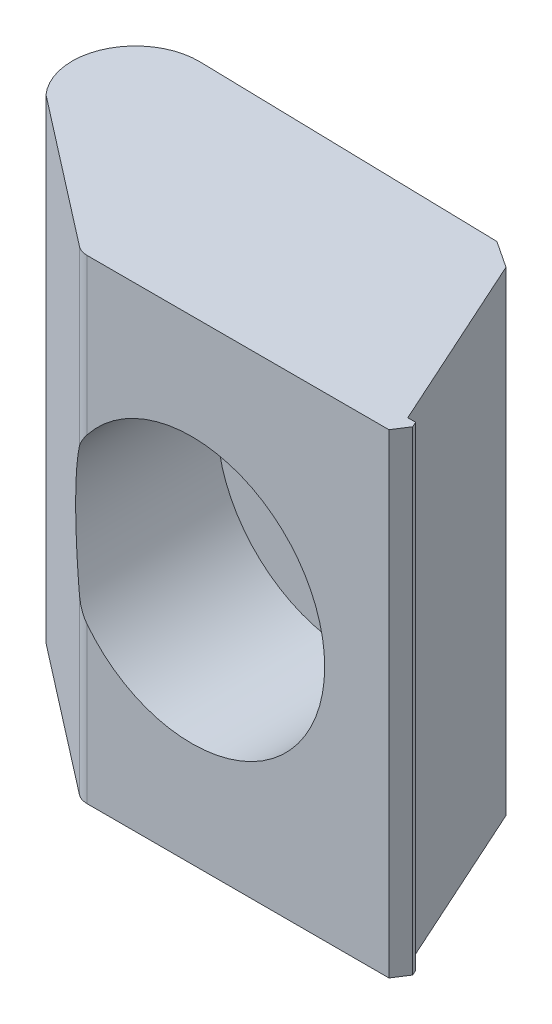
ISO-10303-21;
HEADER;
FILE_DESCRIPTION(('STEP AP214'),'2;1');
FILE_NAME('part.step','',(''),(''),'','','');
FILE_SCHEMA(('AUTOMOTIVE_DESIGN { 1 0 10303 214 1 1 1 1 }'));
ENDSEC;
DATA;
#1=APPLICATION_CONTEXT('core data for automotive mechanical design processes');
#2=APPLICATION_PROTOCOL_DEFINITION('international standard','automotive_design',2000,#1);
#3=PRODUCT_CONTEXT('',#1,'mechanical');
#4=PRODUCT('Part','Part','',(#3));
#5=PRODUCT_RELATED_PRODUCT_CATEGORY('part','',(#4));
#6=PRODUCT_DEFINITION_FORMATION('','',#4);
#7=PRODUCT_DEFINITION_CONTEXT('part definition',#1,'design');
#8=PRODUCT_DEFINITION('design','',#6,#7);
#9=PRODUCT_DEFINITION_SHAPE('','',#8);
#10=(LENGTH_UNIT() NAMED_UNIT(*) SI_UNIT(.MILLI.,.METRE.));
#11=(NAMED_UNIT(*) PLANE_ANGLE_UNIT() SI_UNIT($,.RADIAN.));
#12=(NAMED_UNIT(*) SI_UNIT($,.STERADIAN.) SOLID_ANGLE_UNIT());
#13=UNCERTAINTY_MEASURE_WITH_UNIT(LENGTH_MEASURE(1.E-05),#10,'distance_accuracy_value','');
#14=(GEOMETRIC_REPRESENTATION_CONTEXT(3) GLOBAL_UNCERTAINTY_ASSIGNED_CONTEXT((#13)) GLOBAL_UNIT_ASSIGNED_CONTEXT((#10,
#11,#12)) REPRESENTATION_CONTEXT('',''));
#15=CARTESIAN_POINT('',(0.,0.,0.));
#16=DIRECTION('',(0.,0.,1.));
#17=DIRECTION('',(1.,0.,0.));
#18=AXIS2_PLACEMENT_3D('',#15,#16,#17);
#19=CARTESIAN_POINT('',(-4.19568590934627,9.525,8.28212176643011));
#20=DIRECTION('',(0.,-1.,0.));
#21=DIRECTION('',(-0.0234753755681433,0.,0.999724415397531));
#22=AXIS2_PLACEMENT_3D('',#19,#20,#21);
#23=CYLINDRICAL_SURFACE('',#22,0.762);
#24=CARTESIAN_POINT('',(-4.66212448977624,-2.58877298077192,8.88468217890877));
#25=CARTESIAN_POINT('',(-4.64569720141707,-2.61836804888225,8.8973922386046));
#26=CARTESIAN_POINT('',(-4.6288553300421,-2.64804330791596,8.9093620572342));
#27=CARTESIAN_POINT('',(-4.59435746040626,-2.70747453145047,8.9318374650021));
#28=CARTESIAN_POINT('',(-4.57670147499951,-2.73723049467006,8.94234307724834));
#29=CARTESIAN_POINT('',(-4.52287348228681,-2.82594202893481,8.97150469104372));
#30=CARTESIAN_POINT('',(-4.48553198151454,-2.88490047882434,8.98804348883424));
#31=CARTESIAN_POINT('',(-4.40786571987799,-3.00226698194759,9.01513924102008));
#32=CARTESIAN_POINT('',(-4.36754019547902,-3.06067488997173,9.02569465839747));
#33=CARTESIAN_POINT('',(-4.30482910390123,-3.14769708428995,9.03656646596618));
#34=CARTESIAN_POINT('',(-4.2834503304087,-3.17673976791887,9.03936477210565));
#35=CARTESIAN_POINT('',(-4.24004262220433,-3.23447048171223,9.04314092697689));
#36=CARTESIAN_POINT('',(-4.21801345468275,-3.26315837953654,9.04411811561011));
#37=CARTESIAN_POINT('',(-4.19568590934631,-3.2916274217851,9.04412176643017));
#38=B_SPLINE_CURVE_WITH_KNOTS('',3,(#24,#25,#26,#27,#28,#29,#30,#31,#32,#33,#34,#35,#36,#37),
.UNSPECIFIED.,.F.,.F.,(4,2,2,2,2,2,4),(0.,0.108446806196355,0.216891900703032,0.43174376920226,
0.646650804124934,0.755117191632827,0.863622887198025),.UNSPECIFIED.);
#39=CARTESIAN_POINT('',(-4.66212448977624,-2.58877298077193,8.88468217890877));
#40=VERTEX_POINT('',#39);
#41=CARTESIAN_POINT('',(-4.19568590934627,-3.29162742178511,9.04412176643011));
#42=VERTEX_POINT('',#41);
#43=EDGE_CURVE('E9',#40,#42,#38,.T.);
#44=ORIENTED_EDGE('',*,*,#43,.F.);
#45=DIRECTION('',(0.,-1.,0.));
#46=VECTOR('',#45,1.);
#47=CARTESIAN_POINT('',(-4.66212448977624,9.525,8.88468217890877));
#48=LINE('',#47,#46);
#49=CARTESIAN_POINT('',(-4.66212448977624,-9.525,8.88468217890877));
#50=VERTEX_POINT('',#49);
#51=EDGE_CURVE('E134',#50,#40,#48,.F.);
#52=ORIENTED_EDGE('',*,*,#51,.F.);
#53=CARTESIAN_POINT('',(-4.19568590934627,-9.525,8.28212176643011));
#54=DIRECTION('',(0.,1.,0.));
#55=DIRECTION('',(0.0234753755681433,0.,-0.999724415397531));
#56=AXIS2_PLACEMENT_3D('',#53,#54,#55);
#57=CIRCLE('',#56,0.762);
#58=CARTESIAN_POINT('',(-4.19568590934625,-9.525,9.04412176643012));
#59=VERTEX_POINT('',#58);
#60=EDGE_CURVE('E122',#59,#50,#57,.F.);
#61=ORIENTED_EDGE('',*,*,#60,.F.);
#62=DIRECTION('',(0.,-1.,0.));
#63=VECTOR('',#62,1.);
#64=CARTESIAN_POINT('',(-4.19568590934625,9.525,9.04412176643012));
#65=LINE('',#64,#63);
#66=EDGE_CURVE('E115',#42,#59,#65,.T.);
#67=ORIENTED_EDGE('',*,*,#66,.F.);
#68=EDGE_LOOP('',(#44,#52,#61,#67));
#69=FACE_BOUND('',#68,.T.);
#70=ADVANCED_FACE('F14',(#69),#23,.T.);
#71=CARTESIAN_POINT('',(-8.70835726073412,9.525,2.59252176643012));
#72=DIRECTION('',(0.,-1.,0.));
#73=DIRECTION('',(-0.0234753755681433,0.,0.999724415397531));
#74=AXIS2_PLACEMENT_3D('',#71,#72,#73);
#75=CYLINDRICAL_SURFACE('',#74,2.54);
#76=CARTESIAN_POINT('',(-8.70835726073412,-9.525,2.59252176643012));
#77=DIRECTION('',(0.,1.,0.));
#78=DIRECTION('',(-0.999724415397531,0.,-0.0234753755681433));
#79=AXIS2_PLACEMENT_3D('',#76,#77,#78);
#80=CIRCLE('',#79,2.54);
#81=CARTESIAN_POINT('',(-8.64872980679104,-9.525,0.053221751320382));
#82=VERTEX_POINT('',#81);
#83=CARTESIAN_POINT('',(-10.5982173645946,-9.525,4.28958652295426));
#84=VERTEX_POINT('',#83);
#85=EDGE_CURVE('E215',#82,#84,#80,.T.);
#86=ORIENTED_EDGE('',*,*,#85,.T.);
#87=DIRECTION('',(0.,-1.,0.));
#88=VECTOR('',#87,1.);
#89=CARTESIAN_POINT('',(-10.5982173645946,9.525,4.28958652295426));
#90=LINE('',#89,#88);
#91=CARTESIAN_POINT('',(-10.5982173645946,9.525,4.28958652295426));
#92=VERTEX_POINT('',#91);
#93=EDGE_CURVE('E124',#92,#84,#90,.T.);
#94=ORIENTED_EDGE('',*,*,#93,.F.);
#95=CARTESIAN_POINT('',(-8.70835726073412,9.525,2.59252176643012));
#96=DIRECTION('',(0.,1.,0.));
#97=DIRECTION('',(-0.999724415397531,0.,-0.0234753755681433));
#98=AXIS2_PLACEMENT_3D('',#95,#96,#97);
#99=CIRCLE('',#98,2.54);
#100=CARTESIAN_POINT('',(-8.64872980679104,9.525,0.053221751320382));
#101=VERTEX_POINT('',#100);
#102=EDGE_CURVE('E238',#101,#92,#99,.T.);
#103=ORIENTED_EDGE('',*,*,#102,.F.);
#104=DIRECTION('',(0.,-1.,0.));
#105=VECTOR('',#104,1.);
#106=CARTESIAN_POINT('',(-8.64872980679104,9.525,0.053221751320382));
#107=LINE('',#106,#105);
#108=EDGE_CURVE('E131',#101,#82,#107,.T.);
#109=ORIENTED_EDGE('',*,*,#108,.T.);
#110=EDGE_LOOP('',(#86,#94,#103,#109));
#111=FACE_BOUND('',#110,.T.);
#112=ADVANCED_FACE('F202',(#111),#75,.T.);
#113=CARTESIAN_POINT('',(-10.5982173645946,9.525,4.28958652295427));
#114=DIRECTION('',(0.612124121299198,0.,-0.790761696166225));
#115=DIRECTION('',(0.790761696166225,0.,0.612124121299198));
#116=AXIS2_PLACEMENT_3D('',#113,#114,#115);
#117=PLANE('',#116);
#118=ORIENTED_EDGE('',*,*,#51,.T.);
#119=CARTESIAN_POINT('',(0.00154471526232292,0.,12.4948019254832));
#120=DIRECTION('',(0.612124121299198,0.,-0.790761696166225));
#121=DIRECTION('',(-0.790761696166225,0.,-0.612124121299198));
#122=AXIS2_PLACEMENT_3D('',#119,#120,#121);
#123=ELLIPSE('',#122,6.745395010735,5.334);
#124=CARTESIAN_POINT('',(-4.66212448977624,2.58877298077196,8.88468217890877));
#125=VERTEX_POINT('',#124);
#126=EDGE_CURVE('E106',#40,#125,#123,.T.);
#127=ORIENTED_EDGE('',*,*,#126,.T.);
#128=CARTESIAN_POINT('',(-4.66212448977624,9.525,8.88468217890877));
#129=VERTEX_POINT('',#128);
#130=EDGE_CURVE('E133',#125,#129,#48,.F.);
#131=ORIENTED_EDGE('',*,*,#130,.T.);
#132=DIRECTION('',(0.790761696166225,0.,0.612124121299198));
#133=VECTOR('',#132,1.);
#134=CARTESIAN_POINT('',(-10.5982173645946,9.525,4.28958652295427));
#135=LINE('',#134,#133);
#136=EDGE_CURVE('E265',#92,#129,#135,.T.);
#137=ORIENTED_EDGE('',*,*,#136,.F.);
#138=ORIENTED_EDGE('',*,*,#93,.T.);
#139=DIRECTION('',(0.790761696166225,0.,0.612124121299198));
#140=VECTOR('',#139,1.);
#141=CARTESIAN_POINT('',(-10.5982173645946,-9.525,4.28958652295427));
#142=LINE('',#141,#140);
#143=EDGE_CURVE('E219',#84,#50,#142,.T.);
#144=ORIENTED_EDGE('',*,*,#143,.T.);
#145=EDGE_LOOP('',(#118,#127,#131,#137,#138,#144));
#146=FACE_BOUND('',#145,.T.);
#147=ADVANCED_FACE('F200',(#146),#117,.F.);
#148=CARTESIAN_POINT('',(-4.45615528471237,9.525,9.04412176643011));
#149=DIRECTION('',(0.,0.,-1.));
#150=DIRECTION('',(1.,0.,0.));
#151=AXIS2_PLACEMENT_3D('',#148,#149,#150);
#152=PLANE('',#151);
#153=CARTESIAN_POINT('',(-4.19568590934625,9.525,9.04412176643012));
#154=VERTEX_POINT('',#153);
#155=CARTESIAN_POINT('',(-4.19568590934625,3.29162742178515,9.04412176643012));
#156=VERTEX_POINT('',#155);
#157=EDGE_CURVE('E119',#154,#156,#65,.T.);
#158=ORIENTED_EDGE('',*,*,#157,.T.);
#159=CARTESIAN_POINT('',(0.00154471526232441,0.,9.0441217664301));
#160=DIRECTION('',(0.,0.,-1.));
#161=DIRECTION('',(1.,0.,0.));
#162=AXIS2_PLACEMENT_3D('',#159,#160,#161);
#163=CIRCLE('',#162,5.334);
#164=EDGE_CURVE('E29',#156,#42,#163,.T.);
#165=ORIENTED_EDGE('',*,*,#164,.T.);
#166=ORIENTED_EDGE('',*,*,#66,.T.);
#167=DIRECTION('',(1.,0.,0.));
#168=VECTOR('',#167,1.);
#169=CARTESIAN_POINT('',(-4.45615528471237,-9.525,9.04412176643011));
#170=LINE('',#169,#168);
#171=CARTESIAN_POINT('',(7.91364471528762,-9.525,9.04412176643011));
#172=VERTEX_POINT('',#171);
#173=EDGE_CURVE('E222',#59,#172,#170,.T.);
#174=ORIENTED_EDGE('',*,*,#173,.T.);
#175=DIRECTION('',(0.,1.,0.));
#176=VECTOR('',#175,1.);
#177=CARTESIAN_POINT('',(7.91364471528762,9.525,9.04412176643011));
#178=LINE('',#177,#176);
#179=CARTESIAN_POINT('',(7.91364471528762,9.525,9.04412176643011));
#180=VERTEX_POINT('',#179);
#181=EDGE_CURVE('E143',#172,#180,#178,.T.);
#182=ORIENTED_EDGE('',*,*,#181,.T.);
#183=DIRECTION('',(1.,0.,0.));
#184=VECTOR('',#183,1.);
#185=CARTESIAN_POINT('',(-4.45615528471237,9.525,9.04412176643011));
#186=LINE('',#185,#184);
#187=EDGE_CURVE('E262',#154,#180,#186,.T.);
#188=ORIENTED_EDGE('',*,*,#187,.F.);
#189=EDGE_LOOP('',(#158,#165,#166,#174,#182,#188));
#190=FACE_BOUND('',#189,.T.);
#191=ADVANCED_FACE('F113',(#190),#152,.F.);
#192=CARTESIAN_POINT('',(8.54864471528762,9.525,9.04412176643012));
#193=DIRECTION('',(-0.910969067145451,0.,0.412474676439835));
#194=DIRECTION('',(-0.412474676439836,0.,-0.910969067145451));
#195=AXIS2_PLACEMENT_3D('',#192,#193,#194);
#196=PLANE('',#195);
#197=DIRECTION('',(-0.412474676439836,0.,-0.910969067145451));
#198=VECTOR('',#197,1.);
#199=CARTESIAN_POINT('',(8.54864471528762,9.525,9.04412176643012));
#200=LINE('',#199,#198);
#201=CARTESIAN_POINT('',(8.28672329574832,9.525,8.46565640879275));
#202=VERTEX_POINT('',#201);
#203=CARTESIAN_POINT('',(8.18924527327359,9.525,8.25037176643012));
#204=VERTEX_POINT('',#203);
#205=EDGE_CURVE('E258',#202,#204,#200,.T.);
#206=ORIENTED_EDGE('',*,*,#205,.F.);
#207=DIRECTION('',(0.,-1.,0.));
#208=VECTOR('',#207,1.);
#209=CARTESIAN_POINT('',(8.28672329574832,9.525,8.46565640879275));
#210=LINE('',#209,#208);
#211=CARTESIAN_POINT('',(8.28672329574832,-9.525,8.46565640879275));
#212=VERTEX_POINT('',#211);
#213=EDGE_CURVE('E138',#202,#212,#210,.T.);
#214=ORIENTED_EDGE('',*,*,#213,.T.);
#215=DIRECTION('',(-0.412474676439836,0.,-0.910969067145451));
#216=VECTOR('',#215,1.);
#217=CARTESIAN_POINT('',(8.54864471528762,-9.525,9.04412176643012));
#218=LINE('',#217,#216);
#219=CARTESIAN_POINT('',(8.18924527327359,-9.525,8.25037176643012));
#220=VERTEX_POINT('',#219);
#221=EDGE_CURVE('E230',#212,#220,#218,.T.);
#222=ORIENTED_EDGE('',*,*,#221,.T.);
#223=DIRECTION('',(0.,-1.,0.));
#224=VECTOR('',#223,1.);
#225=CARTESIAN_POINT('',(8.18924527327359,9.525,8.25037176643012));
#226=LINE('',#225,#224);
#227=EDGE_CURVE('E127',#204,#220,#226,.T.);
#228=ORIENTED_EDGE('',*,*,#227,.F.);
#229=EDGE_LOOP('',(#206,#214,#222,#228));
#230=FACE_BOUND('',#229,.T.);
#231=ADVANCED_FACE('F193',(#230),#196,.F.);
#232=CARTESIAN_POINT('',(8.18924527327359,9.525,8.25037176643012));
#233=DIRECTION('',(0.,0.,1.));
#234=DIRECTION('',(-1.,0.,0.));
#235=AXIS2_PLACEMENT_3D('',#232,#233,#234);
#236=PLANE('',#235);
#237=DIRECTION('',(-1.,0.,0.));
#238=VECTOR('',#237,1.);
#239=CARTESIAN_POINT('',(8.18924527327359,-9.525,8.25037176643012));
#240=LINE('',#239,#238);
#241=CARTESIAN_POINT('',(7.87556832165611,-9.525,8.25037176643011));
#242=VERTEX_POINT('',#241);
#243=EDGE_CURVE('E232',#220,#242,#240,.T.);
#244=ORIENTED_EDGE('',*,*,#243,.T.);
#245=DIRECTION('',(0.,-1.,0.));
#246=VECTOR('',#245,1.);
#247=CARTESIAN_POINT('',(7.87556832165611,9.525,8.25037176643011));
#248=LINE('',#247,#246);
#249=CARTESIAN_POINT('',(7.87556832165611,9.525,8.25037176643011));
#250=VERTEX_POINT('',#249);
#251=EDGE_CURVE('E239',#250,#242,#248,.T.);
#252=ORIENTED_EDGE('',*,*,#251,.F.);
#253=DIRECTION('',(-1.,0.,0.));
#254=VECTOR('',#253,1.);
#255=CARTESIAN_POINT('',(8.18924527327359,9.525,8.25037176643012));
#256=LINE('',#255,#254);
#257=EDGE_CURVE('E247',#204,#250,#256,.T.);
#258=ORIENTED_EDGE('',*,*,#257,.F.);
#259=ORIENTED_EDGE('',*,*,#227,.T.);
#260=EDGE_LOOP('',(#244,#252,#258,#259));
#261=FACE_BOUND('',#260,.T.);
#262=ADVANCED_FACE('F190',(#261),#236,.F.);
#263=CARTESIAN_POINT('',(7.87556832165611,9.525,8.25037176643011));
#264=DIRECTION('',(-0.910969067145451,0.,0.412474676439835));
#265=DIRECTION('',(-0.412474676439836,0.,-0.910969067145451));
#266=AXIS2_PLACEMENT_3D('',#263,#264,#265);
#267=PLANE('',#266);
#268=DIRECTION('',(-0.412474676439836,0.,-0.910969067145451));
#269=VECTOR('',#268,1.);
#270=CARTESIAN_POINT('',(7.87556832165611,-9.525,8.25037176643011));
#271=LINE('',#270,#269);
#272=CARTESIAN_POINT('',(4.61600597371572,-9.525,1.05148019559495));
#273=VERTEX_POINT('',#272);
#274=EDGE_CURVE('E234',#242,#273,#271,.T.);
#275=ORIENTED_EDGE('',*,*,#274,.T.);
#276=DIRECTION('',(0.,1.,0.));
#277=VECTOR('',#276,1.);
#278=CARTESIAN_POINT('',(4.61600597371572,9.525,1.05148019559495));
#279=LINE('',#278,#277);
#280=CARTESIAN_POINT('',(4.61600597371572,9.525,1.05148019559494));
#281=VERTEX_POINT('',#280);
#282=EDGE_CURVE('E37',#273,#281,#279,.T.);
#283=ORIENTED_EDGE('',*,*,#282,.T.);
#284=DIRECTION('',(-0.412474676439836,0.,-0.910969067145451));
#285=VECTOR('',#284,1.);
#286=CARTESIAN_POINT('',(7.87556832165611,9.525,8.25037176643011));
#287=LINE('',#286,#285);
#288=EDGE_CURVE('E256',#250,#281,#287,.T.);
#289=ORIENTED_EDGE('',*,*,#288,.F.);
#290=ORIENTED_EDGE('',*,*,#251,.T.);
#291=EDGE_LOOP('',(#275,#283,#289,#290));
#292=FACE_BOUND('',#291,.T.);
#293=ADVANCED_FACE('F186',(#292),#267,.F.);
#294=CARTESIAN_POINT('',(4.30170027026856,9.525,0.357321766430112));
#295=DIRECTION('',(-0.0234753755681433,0.,0.999724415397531));
#296=DIRECTION('',(-0.999724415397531,0.,-0.0234753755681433));
#297=AXIS2_PLACEMENT_3D('',#294,#295,#296);
#298=PLANE('',#297);
#299=CARTESIAN_POINT('',(0.00154471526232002,0.,0.256346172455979));
#300=DIRECTION('',(-0.0234753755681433,0.,0.999724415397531));
#301=DIRECTION('',(-0.999724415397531,0.,-0.0234753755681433));
#302=AXIS2_PLACEMENT_3D('',#299,#300,#301);
#303=ELLIPSE('',#302,3.11235771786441,3.1115);
#304=CARTESIAN_POINT('',(-3.10995528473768,0.,0.183282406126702));
#305=VERTEX_POINT('',#304);
#306=EDGE_CURVE('E18',#305,#305,#303,.T.);
#307=ORIENTED_EDGE('',*,*,#306,.T.);
#308=EDGE_LOOP('',(#307));
#309=FACE_BOUND('',#308,.T.);
#310=DIRECTION('',(-0.999724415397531,0.,-0.0234753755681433));
#311=VECTOR('',#310,1.);
#312=CARTESIAN_POINT('',(4.30170027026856,9.525,0.357321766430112));
#313=LINE('',#312,#311);
#314=CARTESIAN_POINT('',(3.53991026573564,9.525,0.339433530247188));
#315=VERTEX_POINT('',#314);
#316=EDGE_CURVE('E226',#315,#101,#313,.T.);
#317=ORIENTED_EDGE('',*,*,#316,.F.);
#318=DIRECTION('',(0.,-1.,0.));
#319=VECTOR('',#318,1.);
#320=CARTESIAN_POINT('',(3.53991026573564,9.525,0.339433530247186));
#321=LINE('',#320,#319);
#322=CARTESIAN_POINT('',(3.53991026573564,-9.525,0.339433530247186));
#323=VERTEX_POINT('',#322);
#324=EDGE_CURVE('E147',#315,#323,#321,.T.);
#325=ORIENTED_EDGE('',*,*,#324,.T.);
#326=DIRECTION('',(-0.999724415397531,0.,-0.0234753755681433));
#327=VECTOR('',#326,1.);
#328=CARTESIAN_POINT('',(4.30170027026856,-9.525,0.357321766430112));
#329=LINE('',#328,#327);
#330=EDGE_CURVE('E236',#323,#82,#329,.T.);
#331=ORIENTED_EDGE('',*,*,#330,.T.);
#332=ORIENTED_EDGE('',*,*,#108,.F.);
#333=EDGE_LOOP('',(#317,#325,#331,#332));
#334=FACE_BOUND('',#333,.T.);
#335=ADVANCED_FACE('F179',(#309,#334),#298,.F.);
#336=CARTESIAN_POINT('',(-8.70835726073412,9.525,2.59252176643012));
#337=DIRECTION('',(0.,1.,0.));
#338=DIRECTION('',(0.0234753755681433,0.,-0.999724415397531));
#339=AXIS2_PLACEMENT_3D('',#336,#337,#338);
#340=PLANE('',#339);
#341=ORIENTED_EDGE('',*,*,#288,.T.);
#342=DIRECTION('',(0.833959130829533,0.,0.551826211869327));
#343=VECTOR('',#342,1.);
#344=CARTESIAN_POINT('',(-3.94173840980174,9.525,-4.61113262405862));
#345=LINE('',#344,#343);
#346=EDGE_CURVE('E153',#281,#315,#345,.F.);
#347=ORIENTED_EDGE('',*,*,#346,.T.);
#348=ORIENTED_EDGE('',*,*,#316,.T.);
#349=ORIENTED_EDGE('',*,*,#102,.T.);
#350=ORIENTED_EDGE('',*,*,#136,.T.);
#351=CARTESIAN_POINT('',(-4.19568590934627,9.525,8.28212176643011));
#352=DIRECTION('',(0.,1.,0.));
#353=DIRECTION('',(0.0234753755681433,0.,-0.999724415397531));
#354=AXIS2_PLACEMENT_3D('',#351,#352,#353);
#355=CIRCLE('',#354,0.762);
#356=EDGE_CURVE('E136',#129,#154,#355,.T.);
#357=ORIENTED_EDGE('',*,*,#356,.T.);
#358=ORIENTED_EDGE('',*,*,#187,.T.);
#359=DIRECTION('',(-0.541998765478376,0.,0.840379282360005));
#360=VECTOR('',#359,1.);
#361=CARTESIAN_POINT('',(5.96932518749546,9.525,12.0588257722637));
#362=LINE('',#361,#360);
#363=EDGE_CURVE('E145',#180,#202,#362,.F.);
#364=ORIENTED_EDGE('',*,*,#363,.T.);
#365=ORIENTED_EDGE('',*,*,#205,.T.);
#366=ORIENTED_EDGE('',*,*,#257,.T.);
#367=EDGE_LOOP('',(#341,#347,#348,#349,#350,#357,#358,#364,#365,#366));
#368=FACE_BOUND('',#367,.T.);
#369=ADVANCED_FACE('F174',(#368),#340,.T.);
#370=CARTESIAN_POINT('',(-8.70835726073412,-9.525,2.59252176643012));
#371=DIRECTION('',(0.,1.,0.));
#372=DIRECTION('',(0.0234753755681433,0.,-0.999724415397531));
#373=AXIS2_PLACEMENT_3D('',#370,#371,#372);
#374=PLANE('',#373);
#375=ORIENTED_EDGE('',*,*,#330,.F.);
#376=DIRECTION('',(-0.833959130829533,0.,-0.551826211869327));
#377=VECTOR('',#376,1.);
#378=CARTESIAN_POINT('',(3.53991026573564,-9.525,0.339433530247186));
#379=LINE('',#378,#377);
#380=EDGE_CURVE('E150',#323,#273,#379,.F.);
#381=ORIENTED_EDGE('',*,*,#380,.T.);
#382=ORIENTED_EDGE('',*,*,#274,.F.);
#383=ORIENTED_EDGE('',*,*,#243,.F.);
#384=ORIENTED_EDGE('',*,*,#221,.F.);
#385=DIRECTION('',(0.541998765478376,0.,-0.840379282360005));
#386=VECTOR('',#385,1.);
#387=CARTESIAN_POINT('',(8.28672329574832,-9.525,8.46565640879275));
#388=LINE('',#387,#386);
#389=EDGE_CURVE('E141',#212,#172,#388,.F.);
#390=ORIENTED_EDGE('',*,*,#389,.T.);
#391=ORIENTED_EDGE('',*,*,#173,.F.);
#392=ORIENTED_EDGE('',*,*,#60,.T.);
#393=ORIENTED_EDGE('',*,*,#143,.F.);
#394=ORIENTED_EDGE('',*,*,#85,.F.);
#395=EDGE_LOOP('',(#375,#381,#382,#383,#384,#390,#391,#392,#393,#394));
#396=FACE_BOUND('',#395,.T.);
#397=ADVANCED_FACE('F178',(#396),#374,.F.);
#398=CARTESIAN_POINT('',(-4.19568590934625,3.29162742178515,9.04412176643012));
#399=CARTESIAN_POINT('',(-4.23189087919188,3.24547384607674,9.0440938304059));
#400=CARTESIAN_POINT('',(-4.26729841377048,3.19874517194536,9.04154303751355));
#401=CARTESIAN_POINT('',(-4.33633454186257,3.10447256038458,9.03184634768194));
#402=CARTESIAN_POINT('',(-4.3699636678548,3.05692887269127,9.02470183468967));
#403=CARTESIAN_POINT('',(-4.43481923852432,2.96200868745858,9.00639805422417));
#404=CARTESIAN_POINT('',(-4.46607292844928,2.91463932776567,8.99529696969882));
#405=CARTESIAN_POINT('',(-4.52659782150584,2.81968912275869,8.96930923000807));
#406=CARTESIAN_POINT('',(-4.55586963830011,2.77210834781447,8.95442375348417));
#407=CARTESIAN_POINT('',(-4.59756332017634,2.70193561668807,8.92971941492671));
#408=CARTESIAN_POINT('',(-4.61078270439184,2.67930419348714,8.921328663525));
#409=CARTESIAN_POINT('',(-4.63679134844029,2.63402330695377,8.90366612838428));
#410=CARTESIAN_POINT('',(-4.6495789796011,2.61137404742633,8.89439142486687));
#411=CARTESIAN_POINT('',(-4.66212448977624,2.58877298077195,8.88468217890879));
#412=B_SPLINE_CURVE_WITH_KNOTS('',3,(#398,#399,#400,#401,#402,#403,#404,#405,#406,#407,#408,
#409,#410,#411),.UNSPECIFIED.,.F.,.F.,(4,2,2,2,2,2,4),(0.,0.175861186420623,0.351669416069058,
0.524992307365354,0.698261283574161,0.780806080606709,0.863633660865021),.UNSPECIFIED.);
#413=EDGE_CURVE('E23',#156,#125,#412,.T.);
#414=ORIENTED_EDGE('',*,*,#413,.F.);
#415=ORIENTED_EDGE('',*,*,#157,.F.);
#416=ORIENTED_EDGE('',*,*,#356,.F.);
#417=ORIENTED_EDGE('',*,*,#130,.F.);
#418=EDGE_LOOP('',(#414,#415,#416,#417));
#419=FACE_BOUND('',#418,.T.);
#420=ADVANCED_FACE('F165',(#419),#23,.T.);
#421=CARTESIAN_POINT('',(8.28672329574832,9.525,8.46565640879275));
#422=DIRECTION('',(-0.840379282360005,0.,-0.541998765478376));
#423=DIRECTION('',(0.541998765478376,0.,-0.840379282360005));
#424=AXIS2_PLACEMENT_3D('',#421,#422,#423);
#425=PLANE('',#424);
#426=ORIENTED_EDGE('',*,*,#363,.F.);
#427=ORIENTED_EDGE('',*,*,#181,.F.);
#428=ORIENTED_EDGE('',*,*,#389,.F.);
#429=ORIENTED_EDGE('',*,*,#213,.F.);
#430=EDGE_LOOP('',(#426,#427,#428,#429));
#431=FACE_BOUND('',#430,.T.);
#432=ADVANCED_FACE('F291',(#431),#425,.F.);
#433=CARTESIAN_POINT('',(3.53991026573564,9.525,0.339433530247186));
#434=DIRECTION('',(-0.551826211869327,0.,0.833959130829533));
#435=DIRECTION('',(-0.833959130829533,0.,-0.551826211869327));
#436=AXIS2_PLACEMENT_3D('',#433,#434,#435);
#437=PLANE('',#436);
#438=ORIENTED_EDGE('',*,*,#346,.F.);
#439=ORIENTED_EDGE('',*,*,#282,.F.);
#440=ORIENTED_EDGE('',*,*,#380,.F.);
#441=ORIENTED_EDGE('',*,*,#324,.F.);
#442=EDGE_LOOP('',(#438,#439,#440,#441));
#443=FACE_BOUND('',#442,.T.);
#444=ADVANCED_FACE('F16',(#443),#437,.F.);
#445=CARTESIAN_POINT('',(0.00154471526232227,0.,-41.75587823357));
#446=DIRECTION('',(0.,0.,-1.));
#447=DIRECTION('',(1.,0.,0.));
#448=AXIS2_PLACEMENT_3D('',#445,#446,#447);
#449=CYLINDRICAL_SURFACE('',#448,3.1115);
#450=CARTESIAN_POINT('',(0.0015447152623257,0.,2.6941217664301));
#451=DIRECTION('',(0.,0.,-1.));
#452=DIRECTION('',(1.,0.,0.));
#453=AXIS2_PLACEMENT_3D('',#450,#451,#452);
#454=CIRCLE('',#453,3.1115);
#455=CARTESIAN_POINT('',(3.11304471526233,0.,2.6941217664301));
#456=VERTEX_POINT('',#455);
#457=EDGE_CURVE('E270',#456,#456,#454,.T.);
#458=ORIENTED_EDGE('',*,*,#457,.F.);
#459=EDGE_LOOP('',(#458));
#460=FACE_BOUND('',#459,.T.);
#461=ORIENTED_EDGE('',*,*,#306,.F.);
#462=EDGE_LOOP('',(#461));
#463=FACE_BOUND('',#462,.T.);
#464=ADVANCED_FACE('F277',(#460,#463),#449,.F.);
#465=CARTESIAN_POINT('',(0.0015447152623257,0.,2.6941217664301));
#466=DIRECTION('',(0.,0.,-1.));
#467=DIRECTION('',(1.,0.,0.));
#468=AXIS2_PLACEMENT_3D('',#465,#466,#467);
#469=PLANE('',#468);
#470=ORIENTED_EDGE('',*,*,#457,.T.);
#471=EDGE_LOOP('',(#470));
#472=FACE_BOUND('',#471,.T.);
#473=CARTESIAN_POINT('',(0.0015447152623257,0.,2.6941217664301));
#474=DIRECTION('',(0.,0.,-1.));
#475=DIRECTION('',(1.,0.,0.));
#476=AXIS2_PLACEMENT_3D('',#473,#474,#475);
#477=CIRCLE('',#476,5.334);
#478=CARTESIAN_POINT('',(5.33554471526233,0.,2.6941217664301));
#479=VERTEX_POINT('',#478);
#480=EDGE_CURVE('E120',#479,#479,#477,.T.);
#481=ORIENTED_EDGE('',*,*,#480,.F.);
#482=EDGE_LOOP('',(#481));
#483=FACE_BOUND('',#482,.T.);
#484=ADVANCED_FACE('F172',(#472,#483),#469,.F.);
#485=CARTESIAN_POINT('',(0.00154471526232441,0.,9.0441217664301));
#486=DIRECTION('',(0.,0.,-1.));
#487=DIRECTION('',(1.,0.,0.));
#488=AXIS2_PLACEMENT_3D('',#485,#486,#487);
#489=CYLINDRICAL_SURFACE('',#488,5.334);
#490=ORIENTED_EDGE('',*,*,#43,.T.);
#491=ORIENTED_EDGE('',*,*,#164,.F.);
#492=ORIENTED_EDGE('',*,*,#413,.T.);
#493=ORIENTED_EDGE('',*,*,#126,.F.);
#494=EDGE_LOOP('',(#490,#491,#492,#493));
#495=FACE_BOUND('',#494,.T.);
#496=ORIENTED_EDGE('',*,*,#480,.T.);
#497=EDGE_LOOP('',(#496));
#498=FACE_BOUND('',#497,.T.);
#499=ADVANCED_FACE('F103',(#495,#498),#489,.F.);
#500=CLOSED_SHELL('',(#70,#112,#147,#191,#231,#262,#293,#335,#369,#397,#420,#432,#444,#464,#484,#499));
#501=MANIFOLD_SOLID_BREP('B1',#500);
#502=ADVANCED_BREP_SHAPE_REPRESENTATION('',(#18,#501),#14);
#503=SHAPE_DEFINITION_REPRESENTATION(#9,#502);
ENDSEC;
END-ISO-10303-21;
